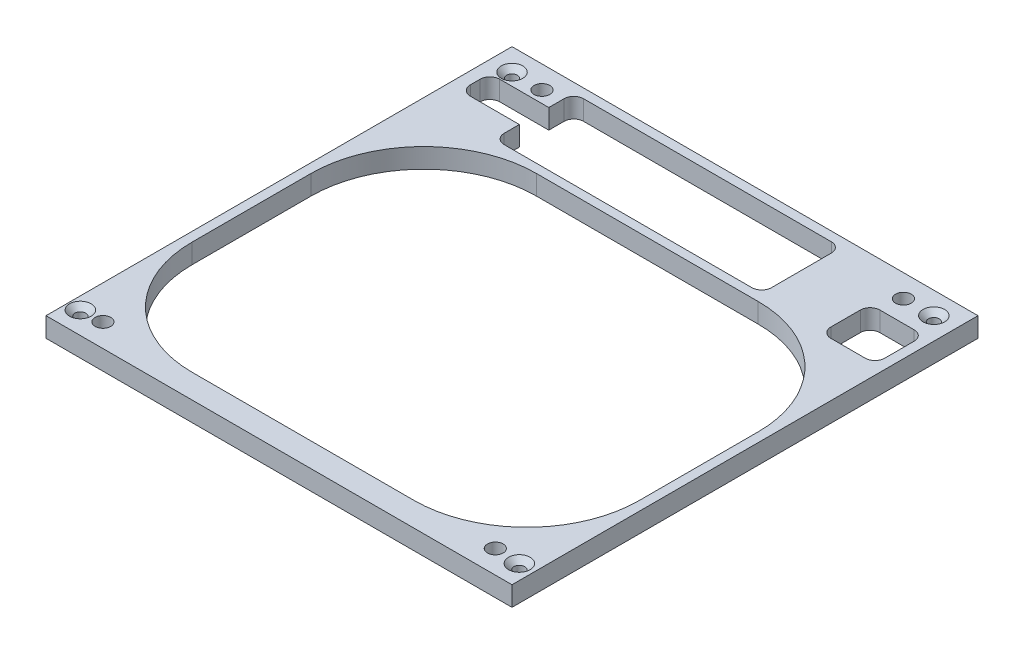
from build123d import *

# Parameters (mm, degrees)
SKETCH1_W                                           = 95
SKETCH1_H                                           = 95
BOSS_EXTRUDE1_DEPTH                                 = 4
CUT_EXTRUDE1_DEPTH                                  = 68.294130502
F_3_2_3_2_DIAMETER_HOLE1_D                          = 3.2
CSK_FOR_M2_COUNTERSUNK_FLAT_HEAD_SCREW1_D           = 2.2
CSK_FOR_M2_COUNTERSUNK_FLAT_HEAD_SCREW1_CSINK_D     = 4.4
CSK_FOR_M2_COUNTERSUNK_FLAT_HEAD_SCREW1_CSINK_ANGLE = 90
CUT_EXTRUDE2_DEPTH                                  = 68.294130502


with BuildPart() as part:
    # Sketch1 → Boss-Extrude1 (new body)
    with BuildSketch(Plane(origin=(0, 0, 0), x_dir=(1, 0, 0), z_dir=(0, 1, 0))):
        Rectangle(SKETCH1_W, SKETCH1_H)
    extrude(amount=BOSS_EXTRUDE1_DEPTH)

    # Sketch2 → Cut-Extrude1 (cut, through all)
    with BuildSketch(Plane(origin=(0, 4, 0), x_dir=(1, 0, 0), z_dir=(0, 1, 0))):
        with BuildLine():
            Line((-22.6, 27.6), (22.6, 27.6))
            ThreePointArc((22.6, 27.6), (38.863455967, 20.863455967), (45.6, 4.6))
            Line((45.6, 4.6), (45.6, -19.6))
            ThreePointArc((45.6, -19.6), (38.863455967, -35.863455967), (22.6, -42.6))
            Line((22.6, -42.6), (-22.6, -42.6))
            ThreePointArc((-22.6, -42.6), (-38.863455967, -35.863455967), (-45.6, -19.6))
            Line((-45.6, -19.6), (-45.6, 4.6))
            ThreePointArc((-45.6, 4.6), (-38.863455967, 20.863455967), (-22.6, 27.6))
        make_face()
        with BuildLine():
            Line((-33, 43.6), (-33, 40.5))
            Line((-33, 40.5), (-43, 40.5))
            ThreePointArc((-43, 40.5), (-44.414213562, 39.914213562), (-45, 38.5))
            Line((-45, 38.5), (-45, 36.5))
            ThreePointArc((-45, 36.5), (-44.414213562, 35.085786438), (-43, 34.5))
            Line((-43, 34.5), (-33, 34.5))
            Line((-33, 34.5), (-33, 31.4))
            ThreePointArc((-33, 31.4), (-32.414213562, 29.985786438), (-31, 29.4))
            Line((-31, 29.4), (19.5, 29.4))
            ThreePointArc((19.5, 29.4), (20.914213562, 29.985786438), (21.5, 31.4))
            Line((21.5, 31.4), (21.5, 43.6))
            ThreePointArc((21.5, 43.6), (20.914213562, 45.014213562), (19.5, 45.6))
            Line((19.5, 45.6), (-31, 45.6))
            ThreePointArc((-31, 45.6), (-32.414213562, 45.014213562), (-33, 43.6))
        make_face()
    extrude(amount=-CUT_EXTRUDE1_DEPTH, mode=Mode.SUBTRACT)

    # 3.2 _3.2_ Diameter Hole1 (through all)
    with Locations(Plane(origin=(0, 4, 0), x_dir=(1, 0, 0), z_dir=(0, 1, 0))):
        with Locations((-36.8, 42.9), (36.9, 42.9), (39.4, -42.8), (-40.6, -42.8)):
            Hole(F_3_2_3_2_DIAMETER_HOLE1_D / 2)

    # CSK for M2 Countersunk Flat Head Screw1 (through all)
    with Locations(Plane(origin=(0, 4, 0), x_dir=(1, 0, 0), z_dir=(0, 1, 0))):
        with Locations((-43, 43), (43, 43), (44.5, -43), (-45, -43)):
            CounterSinkHole(CSK_FOR_M2_COUNTERSUNK_FLAT_HEAD_SCREW1_D / 2, CSK_FOR_M2_COUNTERSUNK_FLAT_HEAD_SCREW1_CSINK_D / 2, counter_sink_angle=CSK_FOR_M2_COUNTERSUNK_FLAT_HEAD_SCREW1_CSINK_ANGLE)

    # Sketch7 → Cut-Extrude2 (cut, through all)
    with BuildSketch(Plane(origin=(0, 4, 0), x_dir=(1, 0, 0), z_dir=(0, 1, 0))):
        with BuildLine():
            Line((43.5, 38.5), (36.5, 38.5))
            ThreePointArc((36.5, 38.5), (35.085786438, 37.914213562), (34.5, 36.5))
            Line((34.5, 36.5), (34.5, 30.5))
            ThreePointArc((34.5, 30.5), (35.085786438, 29.085786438), (36.5, 28.5))
            Line((36.5, 28.5), (43.5, 28.5))
            ThreePointArc((43.5, 28.5), (44.914213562, 29.085786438), (45.5, 30.5))
            Line((45.5, 30.5), (45.5, 36.5))
            ThreePointArc((45.5, 36.5), (44.914213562, 37.914213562), (43.5, 38.5))
        make_face()
    extrude(amount=-CUT_EXTRUDE2_DEPTH, mode=Mode.SUBTRACT)


solid = part.part
